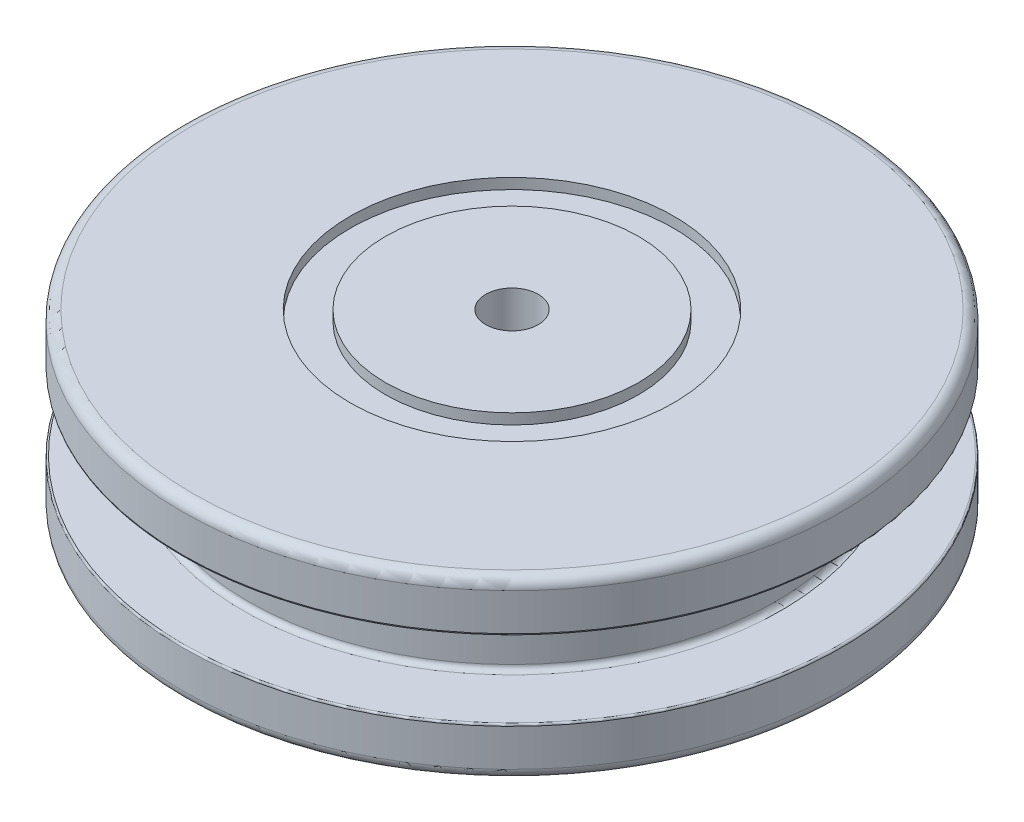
ISO-10303-21;
HEADER;
FILE_DESCRIPTION(('STEP AP214'),'2;1');
FILE_NAME('part.step','',(''),(''),'','','');
FILE_SCHEMA(('AUTOMOTIVE_DESIGN { 1 0 10303 214 1 1 1 1 }'));
ENDSEC;
DATA;
#1=APPLICATION_CONTEXT('core data for automotive mechanical design processes');
#2=APPLICATION_PROTOCOL_DEFINITION('international standard','automotive_design',2000,#1);
#3=PRODUCT_CONTEXT('',#1,'mechanical');
#4=PRODUCT('Part','Part','',(#3));
#5=PRODUCT_RELATED_PRODUCT_CATEGORY('part','',(#4));
#6=PRODUCT_DEFINITION_FORMATION('','',#4);
#7=PRODUCT_DEFINITION_CONTEXT('part definition',#1,'design');
#8=PRODUCT_DEFINITION('design','',#6,#7);
#9=PRODUCT_DEFINITION_SHAPE('','',#8);
#10=(LENGTH_UNIT() NAMED_UNIT(*) SI_UNIT(.MILLI.,.METRE.));
#11=(NAMED_UNIT(*) PLANE_ANGLE_UNIT() SI_UNIT($,.RADIAN.));
#12=(NAMED_UNIT(*) SI_UNIT($,.STERADIAN.) SOLID_ANGLE_UNIT());
#13=UNCERTAINTY_MEASURE_WITH_UNIT(LENGTH_MEASURE(1.E-05),#10,'distance_accuracy_value','');
#14=(GEOMETRIC_REPRESENTATION_CONTEXT(3) GLOBAL_UNCERTAINTY_ASSIGNED_CONTEXT((#13)) GLOBAL_UNIT_ASSIGNED_CONTEXT((#10,
#11,#12)) REPRESENTATION_CONTEXT('',''));
#15=CARTESIAN_POINT('',(0.,0.,0.));
#16=DIRECTION('',(0.,0.,1.));
#17=DIRECTION('',(1.,0.,0.));
#18=AXIS2_PLACEMENT_3D('',#15,#16,#17);
#19=CARTESIAN_POINT('',(0.,0.,0.));
#20=DIRECTION('',(0.,-1.,0.));
#21=DIRECTION('',(0.,0.,-1.));
#22=AXIS2_PLACEMENT_3D('',#19,#20,#21);
#23=CYLINDRICAL_SURFACE('',#22,23.7998);
#24=CARTESIAN_POINT('',(0.,3.4544,0.));
#25=DIRECTION('',(0.,1.,0.));
#26=DIRECTION('',(0.,0.,1.));
#27=AXIS2_PLACEMENT_3D('',#24,#25,#26);
#28=CIRCLE('',#27,23.7998);
#29=CARTESIAN_POINT('',(0.,3.4544,23.7998));
#30=VERTEX_POINT('',#29);
#31=EDGE_CURVE('E44',#30,#30,#28,.F.);
#32=ORIENTED_EDGE('',*,*,#31,.T.);
#33=EDGE_LOOP('',(#32));
#34=FACE_BOUND('',#33,.T.);
#35=CARTESIAN_POINT('',(0.,0.762,0.));
#36=DIRECTION('',(0.,-1.,0.));
#37=DIRECTION('',(0.,0.,-1.));
#38=AXIS2_PLACEMENT_3D('',#35,#36,#37);
#39=CIRCLE('',#38,23.7998);
#40=CARTESIAN_POINT('',(0.,0.762,-23.7998));
#41=VERTEX_POINT('',#40);
#42=EDGE_CURVE('E81',#41,#41,#39,.T.);
#43=ORIENTED_EDGE('',*,*,#42,.F.);
#44=EDGE_LOOP('',(#43));
#45=FACE_BOUND('',#44,.T.);
#46=ADVANCED_FACE('F37',(#34,#45),#23,.T.);
#47=CARTESIAN_POINT('',(-5.08,0.,0.));
#48=DIRECTION('',(0.,1.,0.));
#49=DIRECTION('',(0.,0.,1.));
#50=AXIS2_PLACEMENT_3D('',#47,#48,#49);
#51=PLANE('',#50);
#52=CARTESIAN_POINT('',(0.,0.,0.));
#53=DIRECTION('',(0.,1.,0.));
#54=DIRECTION('',(0.,0.,1.));
#55=AXIS2_PLACEMENT_3D('',#52,#53,#54);
#56=CIRCLE('',#55,3.175);
#57=CARTESIAN_POINT('',(0.,0.,-3.175));
#58=VERTEX_POINT('',#57);
#59=EDGE_CURVE('E88',#58,#58,#56,.T.);
#60=ORIENTED_EDGE('',*,*,#59,.T.);
#61=EDGE_LOOP('',(#60));
#62=FACE_BOUND('',#61,.T.);
#63=CARTESIAN_POINT('',(0.,0.,0.));
#64=DIRECTION('',(0.,-1.,0.));
#65=DIRECTION('',(0.,0.,-1.));
#66=AXIS2_PLACEMENT_3D('',#63,#64,#65);
#67=CIRCLE('',#66,5.08);
#68=CARTESIAN_POINT('',(0.,0.,-5.08));
#69=VERTEX_POINT('',#68);
#70=EDGE_CURVE('E60',#69,#69,#67,.T.);
#71=ORIENTED_EDGE('',*,*,#70,.T.);
#72=EDGE_LOOP('',(#71));
#73=FACE_BOUND('',#72,.T.);
#74=ADVANCED_FACE('F149',(#62,#73),#51,.F.);
#75=CARTESIAN_POINT('',(0.,5.30137558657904,0.));
#76=DIRECTION('',(0.,1.,0.));
#77=DIRECTION('',(0.,0.,1.));
#78=AXIS2_PLACEMENT_3D('',#75,#76,#77);
#79=CONICAL_SURFACE('',#78,5.54381026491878,0.08726646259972);
#80=ORIENTED_EDGE('',*,*,#70,.F.);
#81=EDGE_LOOP('',(#80));
#82=FACE_BOUND('',#81,.T.);
#83=CARTESIAN_POINT('',(0.,5.30137558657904,0.));
#84=DIRECTION('',(0.,-1.,0.));
#85=DIRECTION('',(0.,0.,-1.));
#86=AXIS2_PLACEMENT_3D('',#83,#84,#85);
#87=CIRCLE('',#86,5.54381026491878);
#88=CARTESIAN_POINT('',(0.,5.30137558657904,-5.54381026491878));
#89=VERTEX_POINT('',#88);
#90=EDGE_CURVE('E63',#89,#89,#87,.T.);
#91=ORIENTED_EDGE('',*,*,#90,.T.);
#92=EDGE_LOOP('',(#91));
#93=FACE_BOUND('',#92,.T.);
#94=ADVANCED_FACE('F157',(#82,#93),#79,.T.);
#95=CARTESIAN_POINT('',(0.,5.08,0.));
#96=DIRECTION('',(0.,-1.,0.));
#97=DIRECTION('',(0.,0.,-1.));
#98=AXIS2_PLACEMENT_3D('',#95,#96,#97);
#99=TOROIDAL_SURFACE('',#98,8.07414479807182,2.54);
#100=ORIENTED_EDGE('',*,*,#90,.F.);
#101=EDGE_LOOP('',(#100));
#102=FACE_BOUND('',#101,.T.);
#103=CARTESIAN_POINT('',(0.,7.62,0.));
#104=DIRECTION('',(0.,-1.,0.));
#105=DIRECTION('',(0.,0.,-1.));
#106=AXIS2_PLACEMENT_3D('',#103,#104,#105);
#107=CIRCLE('',#106,8.07414479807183);
#108=CARTESIAN_POINT('',(0.,7.62,-8.07414479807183));
#109=VERTEX_POINT('',#108);
#110=EDGE_CURVE('E66',#109,#109,#107,.T.);
#111=ORIENTED_EDGE('',*,*,#110,.T.);
#112=EDGE_LOOP('',(#111));
#113=FACE_BOUND('',#112,.T.);
#114=ADVANCED_FACE('F242',(#102,#113),#99,.F.);
#115=CARTESIAN_POINT('',(-11.9526975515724,7.62,0.));
#116=DIRECTION('',(0.,1.,0.));
#117=DIRECTION('',(0.,0.,1.));
#118=AXIS2_PLACEMENT_3D('',#115,#116,#117);
#119=PLANE('',#118);
#120=ORIENTED_EDGE('',*,*,#110,.F.);
#121=EDGE_LOOP('',(#120));
#122=FACE_BOUND('',#121,.T.);
#123=CARTESIAN_POINT('',(0.,7.62,0.));
#124=DIRECTION('',(0.,-1.,0.));
#125=DIRECTION('',(0.,0.,-1.));
#126=AXIS2_PLACEMENT_3D('',#123,#124,#125);
#127=CIRCLE('',#126,11.9526975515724);
#128=CARTESIAN_POINT('',(0.,7.62,-11.9526975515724));
#129=VERTEX_POINT('',#128);
#130=EDGE_CURVE('E69',#129,#129,#127,.T.);
#131=ORIENTED_EDGE('',*,*,#130,.T.);
#132=EDGE_LOOP('',(#131));
#133=FACE_BOUND('',#132,.T.);
#134=ADVANCED_FACE('F247',(#122,#133),#119,.F.);
#135=CARTESIAN_POINT('',(0.,5.08,0.));
#136=DIRECTION('',(0.,-1.,0.));
#137=DIRECTION('',(0.,0.,-1.));
#138=AXIS2_PLACEMENT_3D('',#135,#136,#137);
#139=TOROIDAL_SURFACE('',#138,11.9526975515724,2.54);
#140=ORIENTED_EDGE('',*,*,#130,.F.);
#141=EDGE_LOOP('',(#140));
#142=FACE_BOUND('',#141,.T.);
#143=CARTESIAN_POINT('',(0.,6.87605122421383,0.));
#144=DIRECTION('',(0.,-1.,0.));
#145=DIRECTION('',(0.,0.,-1.));
#146=AXIS2_PLACEMENT_3D('',#143,#144,#145);
#147=CIRCLE('',#146,13.7487487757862);
#148=CARTESIAN_POINT('',(0.,6.87605122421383,-13.7487487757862));
#149=VERTEX_POINT('',#148);
#150=EDGE_CURVE('E72',#149,#149,#147,.T.);
#151=ORIENTED_EDGE('',*,*,#150,.T.);
#152=EDGE_LOOP('',(#151));
#153=FACE_BOUND('',#152,.T.);
#154=ADVANCED_FACE('F253',(#142,#153),#139,.F.);
#155=CARTESIAN_POINT('',(0.,0.,0.));
#156=DIRECTION('',(0.,-1.,0.));
#157=DIRECTION('',(0.,0.,-1.));
#158=AXIS2_PLACEMENT_3D('',#155,#156,#157);
#159=CONICAL_SURFACE('',#158,20.6248,0.785398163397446);
#160=ORIENTED_EDGE('',*,*,#150,.F.);
#161=EDGE_LOOP('',(#160));
#162=FACE_BOUND('',#161,.T.);
#163=CARTESIAN_POINT('',(0.,0.,0.));
#164=DIRECTION('',(0.,-1.,0.));
#165=DIRECTION('',(0.,0.,-1.));
#166=AXIS2_PLACEMENT_3D('',#163,#164,#165);
#167=CIRCLE('',#166,20.6248);
#168=CARTESIAN_POINT('',(0.,0.,-20.6248));
#169=VERTEX_POINT('',#168);
#170=EDGE_CURVE('E75',#169,#169,#167,.T.);
#171=ORIENTED_EDGE('',*,*,#170,.T.);
#172=EDGE_LOOP('',(#171));
#173=FACE_BOUND('',#172,.T.);
#174=ADVANCED_FACE('F259',(#162,#173),#159,.F.);
#175=CARTESIAN_POINT('',(-20.6248,0.,0.));
#176=DIRECTION('',(0.,1.,0.));
#177=DIRECTION('',(0.,0.,1.));
#178=AXIS2_PLACEMENT_3D('',#175,#176,#177);
#179=PLANE('',#178);
#180=ORIENTED_EDGE('',*,*,#170,.F.);
#181=EDGE_LOOP('',(#180));
#182=FACE_BOUND('',#181,.T.);
#183=CARTESIAN_POINT('',(0.,0.,0.));
#184=DIRECTION('',(0.,-1.,0.));
#185=DIRECTION('',(0.,0.,-1.));
#186=AXIS2_PLACEMENT_3D('',#183,#184,#185);
#187=CIRCLE('',#186,23.0378);
#188=CARTESIAN_POINT('',(0.,0.,-23.0378));
#189=VERTEX_POINT('',#188);
#190=EDGE_CURVE('E78',#189,#189,#187,.T.);
#191=ORIENTED_EDGE('',*,*,#190,.T.);
#192=EDGE_LOOP('',(#191));
#193=FACE_BOUND('',#192,.T.);
#194=ADVANCED_FACE('F265',(#182,#193),#179,.F.);
#195=CARTESIAN_POINT('',(0.,0.762,0.));
#196=DIRECTION('',(0.,-1.,0.));
#197=DIRECTION('',(0.,0.,-1.));
#198=AXIS2_PLACEMENT_3D('',#195,#196,#197);
#199=TOROIDAL_SURFACE('',#198,23.0378,0.761999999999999);
#200=ORIENTED_EDGE('',*,*,#190,.F.);
#201=EDGE_LOOP('',(#200));
#202=FACE_BOUND('',#201,.T.);
#203=ORIENTED_EDGE('',*,*,#42,.T.);
#204=EDGE_LOOP('',(#203));
#205=FACE_BOUND('',#204,.T.);
#206=ADVANCED_FACE('F230',(#202,#205),#199,.T.);
#207=CARTESIAN_POINT('',(0.,7.62,0.));
#208=DIRECTION('',(0.,-1.,0.));
#209=DIRECTION('',(0.,0.,-1.));
#210=AXIS2_PLACEMENT_3D('',#207,#208,#209);
#211=CYLINDRICAL_SURFACE('',#210,3.175);
#212=CARTESIAN_POINT('',(0.,7.62,0.));
#213=DIRECTION('',(0.,1.,0.));
#214=DIRECTION('',(0.,0.,1.));
#215=AXIS2_PLACEMENT_3D('',#212,#213,#214);
#216=CIRCLE('',#215,3.175);
#217=CARTESIAN_POINT('',(0.,7.62,-3.175));
#218=VERTEX_POINT('',#217);
#219=EDGE_CURVE('E87',#218,#218,#216,.T.);
#220=CARTESIAN_POINT('',(0.,7.62,-3.175));
#221=CARTESIAN_POINT('',(0.,7.540625,-3.175));
#222=CARTESIAN_POINT('',(0.,7.46125,-3.175));
#223=CARTESIAN_POINT('',(0.,7.3025,-3.175));
#224=CARTESIAN_POINT('',(0.,7.223125,-3.175));
#225=CARTESIAN_POINT('',(0.,7.064375,-3.175));
#226=CARTESIAN_POINT('',(0.,6.985,-3.175));
#227=CARTESIAN_POINT('',(0.,6.82625,-3.175));
#228=CARTESIAN_POINT('',(0.,6.746875,-3.175));
#229=CARTESIAN_POINT('',(0.,6.588125,-3.175));
#230=CARTESIAN_POINT('',(0.,6.50875,-3.175));
#231=CARTESIAN_POINT('',(0.,6.35,-3.175));
#232=CARTESIAN_POINT('',(0.,6.270625,-3.175));
#233=CARTESIAN_POINT('',(0.,6.111875,-3.175));
#234=CARTESIAN_POINT('',(0.,6.0325,-3.175));
#235=CARTESIAN_POINT('',(0.,5.87375,-3.175));
#236=CARTESIAN_POINT('',(0.,5.794375,-3.175));
#237=CARTESIAN_POINT('',(0.,5.635625,-3.175));
#238=CARTESIAN_POINT('',(0.,5.55625,-3.175));
#239=CARTESIAN_POINT('',(0.,5.3975,-3.175));
#240=CARTESIAN_POINT('',(0.,5.318125,-3.175));
#241=CARTESIAN_POINT('',(0.,5.159375,-3.175));
#242=CARTESIAN_POINT('',(0.,5.08,-3.175));
#243=CARTESIAN_POINT('',(0.,4.92125,-3.175));
#244=CARTESIAN_POINT('',(0.,4.841875,-3.175));
#245=CARTESIAN_POINT('',(0.,4.683125,-3.175));
#246=CARTESIAN_POINT('',(0.,4.60375,-3.175));
#247=CARTESIAN_POINT('',(0.,4.445,-3.175));
#248=CARTESIAN_POINT('',(0.,4.365625,-3.175));
#249=CARTESIAN_POINT('',(0.,4.206875,-3.175));
#250=CARTESIAN_POINT('',(0.,4.1275,-3.175));
#251=CARTESIAN_POINT('',(0.,3.96875,-3.175));
#252=CARTESIAN_POINT('',(0.,3.889375,-3.175));
#253=CARTESIAN_POINT('',(0.,3.730625,-3.175));
#254=CARTESIAN_POINT('',(0.,3.65125,-3.175));
#255=CARTESIAN_POINT('',(0.,3.4925,-3.175));
#256=CARTESIAN_POINT('',(0.,3.413125,-3.175));
#257=CARTESIAN_POINT('',(0.,3.254375,-3.175));
#258=CARTESIAN_POINT('',(0.,3.175,-3.175));
#259=CARTESIAN_POINT('',(0.,3.01625,-3.175));
#260=CARTESIAN_POINT('',(0.,2.936875,-3.175));
#261=CARTESIAN_POINT('',(0.,2.778125,-3.175));
#262=CARTESIAN_POINT('',(0.,2.69875,-3.175));
#263=CARTESIAN_POINT('',(0.,2.54,-3.175));
#264=CARTESIAN_POINT('',(0.,2.460625,-3.175));
#265=CARTESIAN_POINT('',(0.,2.301875,-3.175));
#266=CARTESIAN_POINT('',(0.,2.2225,-3.175));
#267=CARTESIAN_POINT('',(0.,2.06375,-3.175));
#268=CARTESIAN_POINT('',(0.,1.984375,-3.175));
#269=CARTESIAN_POINT('',(0.,1.825625,-3.175));
#270=CARTESIAN_POINT('',(0.,1.74625,-3.175));
#271=CARTESIAN_POINT('',(0.,1.5875,-3.175));
#272=CARTESIAN_POINT('',(0.,1.508125,-3.175));
#273=CARTESIAN_POINT('',(0.,1.349375,-3.175));
#274=CARTESIAN_POINT('',(0.,1.27,-3.175));
#275=CARTESIAN_POINT('',(0.,1.11125,-3.175));
#276=CARTESIAN_POINT('',(0.,1.031875,-3.175));
#277=CARTESIAN_POINT('',(0.,0.873125,-3.175));
#278=CARTESIAN_POINT('',(0.,0.79375,-3.175));
#279=CARTESIAN_POINT('',(0.,0.635,-3.175));
#280=CARTESIAN_POINT('',(0.,0.555625,-3.175));
#281=CARTESIAN_POINT('',(0.,0.396875,-3.175));
#282=CARTESIAN_POINT('',(0.,0.3175,-3.175));
#283=CARTESIAN_POINT('',(0.,0.15875,-3.175));
#284=CARTESIAN_POINT('',(0.,0.0793749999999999,-3.175));
#285=CARTESIAN_POINT('',(0.,0.,-3.175));
#286=B_SPLINE_CURVE_WITH_KNOTS('',3,(#220,#221,#222,#223,#224,#225,#226,#227,#228,#229,#230,
#231,#232,#233,#234,#235,#236,#237,#238,#239,#240,#241,#242,#243,#244,#245,#246,#247,#248,#249,
#250,#251,#252,#253,#254,#255,#256,#257,#258,#259,#260,#261,#262,#263,#264,#265,#266,#267,#268,
#269,#270,#271,#272,#273,#274,#275,#276,#277,#278,#279,#280,#281,#282,#283,#284,#285),
.UNSPECIFIED.,.F.,.F.,(4,2,2,2,2,2,2,2,2,2,2,2,2,2,2,2,2,2,2,2,2,2,2,2,2,2,2,2,2,2,2,2,4),(0.,
0.238125,0.47625,0.714375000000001,0.9525,1.190625,1.42875,1.666875,1.905,2.143125,2.38125,
2.619375,2.8575,3.095625,3.33375,3.571875,3.81,4.048125,4.28625,4.524375,4.7625,5.000625,
5.23875,5.476875,5.715,5.953125,6.19125,6.429375,6.6675,6.905625,7.14375,7.381875,7.62),.UNSPECIFIED.);
#287=EDGE_CURVE('BSEAM225',#218,#58,#286,.T.);
#288=ORIENTED_EDGE('',*,*,#219,.T.);
#289=ORIENTED_EDGE('',*,*,#59,.F.);
#290=ORIENTED_EDGE('',*,*,#287,.T.);
#291=ORIENTED_EDGE('',*,*,#287,.F.);
#292=EDGE_LOOP('',(#288,#290,#289,#291));
#293=FACE_BOUND('',#292,.T.);
#294=ADVANCED_FACE('F225',(#293),#211,.F.);
#295=CARTESIAN_POINT('',(0.,7.62,0.));
#296=DIRECTION('',(0.,1.,0.));
#297=DIRECTION('',(0.,0.,1.));
#298=AXIS2_PLACEMENT_3D('',#295,#296,#297);
#299=PLANE('',#298);
#300=CARTESIAN_POINT('',(0.,7.62,0.));
#301=DIRECTION('',(0.,1.,0.));
#302=DIRECTION('',(0.,0.,1.));
#303=AXIS2_PLACEMENT_3D('',#300,#301,#302);
#304=CIRCLE('',#303,1.89865);
#305=CARTESIAN_POINT('',(0.,7.62,1.89865));
#306=VERTEX_POINT('',#305);
#307=EDGE_CURVE('E117',#306,#306,#304,.T.);
#308=ORIENTED_EDGE('',*,*,#307,.T.);
#309=EDGE_LOOP('',(#308));
#310=FACE_BOUND('',#309,.T.);
#311=ORIENTED_EDGE('',*,*,#219,.F.);
#312=EDGE_LOOP('',(#311));
#313=FACE_BOUND('',#312,.T.);
#314=ADVANCED_FACE('F221',(#310,#313),#299,.F.);
#315=CARTESIAN_POINT('',(-23.7998,3.5814,0.));
#316=DIRECTION('',(0.,1.,0.));
#317=DIRECTION('',(0.,0.,1.));
#318=AXIS2_PLACEMENT_3D('',#315,#316,#317);
#319=PLANE('',#318);
#320=CARTESIAN_POINT('',(0.,3.5814,0.));
#321=DIRECTION('',(0.,1.,0.));
#322=DIRECTION('',(0.,0.,1.));
#323=AXIS2_PLACEMENT_3D('',#320,#321,#322);
#324=CIRCLE('',#323,23.6728);
#325=CARTESIAN_POINT('',(0.,3.5814,23.6728));
#326=VERTEX_POINT('',#325);
#327=EDGE_CURVE('E10',#326,#326,#324,.T.);
#328=ORIENTED_EDGE('',*,*,#327,.T.);
#329=EDGE_LOOP('',(#328));
#330=FACE_BOUND('',#329,.T.);
#331=CARTESIAN_POINT('',(0.,3.5814,0.));
#332=DIRECTION('',(0.,-1.,0.));
#333=DIRECTION('',(0.,0.,-1.));
#334=AXIS2_PLACEMENT_3D('',#331,#332,#333);
#335=CIRCLE('',#334,19.431);
#336=CARTESIAN_POINT('',(0.,3.5814,-19.431));
#337=VERTEX_POINT('',#336);
#338=EDGE_CURVE('E103',#337,#337,#335,.T.);
#339=ORIENTED_EDGE('',*,*,#338,.T.);
#340=EDGE_LOOP('',(#339));
#341=FACE_BOUND('',#340,.T.);
#342=ADVANCED_FACE('F217',(#330,#341),#319,.T.);
#343=CARTESIAN_POINT('',(0.,3.9624,0.));
#344=DIRECTION('',(0.,-1.,0.));
#345=DIRECTION('',(0.,0.,-1.));
#346=AXIS2_PLACEMENT_3D('',#343,#344,#345);
#347=TOROIDAL_SURFACE('',#346,19.431,0.381);
#348=CARTESIAN_POINT('',(0.,3.9624,0.));
#349=DIRECTION('',(0.,-1.,0.));
#350=DIRECTION('',(0.,0.,-1.));
#351=AXIS2_PLACEMENT_3D('',#348,#349,#350);
#352=CIRCLE('',#351,19.05);
#353=CARTESIAN_POINT('',(0.,3.9624,-19.05));
#354=VERTEX_POINT('',#353);
#355=EDGE_CURVE('E108',#354,#354,#352,.T.);
#356=ORIENTED_EDGE('',*,*,#355,.T.);
#357=EDGE_LOOP('',(#356));
#358=FACE_BOUND('',#357,.T.);
#359=ORIENTED_EDGE('',*,*,#338,.F.);
#360=EDGE_LOOP('',(#359));
#361=FACE_BOUND('',#360,.T.);
#362=ADVANCED_FACE('F212',(#358,#361),#347,.F.);
#363=CARTESIAN_POINT('',(0.,0.,0.));
#364=DIRECTION('',(0.,-1.,0.));
#365=DIRECTION('',(0.,0.,-1.));
#366=AXIS2_PLACEMENT_3D('',#363,#364,#365);
#367=CYLINDRICAL_SURFACE('',#366,19.05);
#368=CARTESIAN_POINT('',(0.,8.7376,0.));
#369=DIRECTION('',(0.,-1.,0.));
#370=DIRECTION('',(0.,0.,-1.));
#371=AXIS2_PLACEMENT_3D('',#368,#369,#370);
#372=CIRCLE('',#371,19.05);
#373=CARTESIAN_POINT('',(0.,8.7376,-19.05));
#374=VERTEX_POINT('',#373);
#375=EDGE_CURVE('E111',#374,#374,#372,.T.);
#376=ORIENTED_EDGE('',*,*,#375,.T.);
#377=EDGE_LOOP('',(#376));
#378=FACE_BOUND('',#377,.T.);
#379=ORIENTED_EDGE('',*,*,#355,.F.);
#380=EDGE_LOOP('',(#379));
#381=FACE_BOUND('',#380,.T.);
#382=ADVANCED_FACE('F206',(#378,#381),#367,.T.);
#383=CARTESIAN_POINT('',(0.,8.7376,0.));
#384=DIRECTION('',(0.,-1.,0.));
#385=DIRECTION('',(0.,0.,-1.));
#386=AXIS2_PLACEMENT_3D('',#383,#384,#385);
#387=TOROIDAL_SURFACE('',#386,19.431,0.380999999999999);
#388=CARTESIAN_POINT('',(0.,9.11859999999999,0.));
#389=DIRECTION('',(0.,-1.,0.));
#390=DIRECTION('',(0.,0.,-1.));
#391=AXIS2_PLACEMENT_3D('',#388,#389,#390);
#392=CIRCLE('',#391,19.431);
#393=CARTESIAN_POINT('',(0.,9.11859999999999,-19.431));
#394=VERTEX_POINT('',#393);
#395=EDGE_CURVE('E114',#394,#394,#392,.T.);
#396=ORIENTED_EDGE('',*,*,#395,.T.);
#397=EDGE_LOOP('',(#396));
#398=FACE_BOUND('',#397,.T.);
#399=ORIENTED_EDGE('',*,*,#375,.F.);
#400=EDGE_LOOP('',(#399));
#401=FACE_BOUND('',#400,.T.);
#402=ADVANCED_FACE('F200',(#398,#401),#387,.F.);
#403=CARTESIAN_POINT('',(-23.7998,9.11859999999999,0.));
#404=DIRECTION('',(0.,-1.,0.));
#405=DIRECTION('',(0.,0.,-1.));
#406=AXIS2_PLACEMENT_3D('',#403,#404,#405);
#407=PLANE('',#406);
#408=CARTESIAN_POINT('',(0.,9.11859999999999,0.));
#409=DIRECTION('',(0.,-1.,0.));
#410=DIRECTION('',(0.,0.,-1.));
#411=AXIS2_PLACEMENT_3D('',#408,#409,#410);
#412=CIRCLE('',#411,23.6728);
#413=CARTESIAN_POINT('',(0.,9.11859999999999,-23.6728));
#414=VERTEX_POINT('',#413);
#415=EDGE_CURVE('E52',#414,#414,#412,.T.);
#416=ORIENTED_EDGE('',*,*,#415,.T.);
#417=EDGE_LOOP('',(#416));
#418=FACE_BOUND('',#417,.T.);
#419=ORIENTED_EDGE('',*,*,#395,.F.);
#420=EDGE_LOOP('',(#419));
#421=FACE_BOUND('',#420,.T.);
#422=ADVANCED_FACE('F131',(#418,#421),#407,.T.);
#423=CARTESIAN_POINT('',(-23.0378,12.7,0.));
#424=DIRECTION('',(0.,-1.,0.));
#425=DIRECTION('',(0.,0.,-1.));
#426=AXIS2_PLACEMENT_3D('',#423,#424,#425);
#427=PLANE('',#426);
#428=CARTESIAN_POINT('',(0.,12.7,0.));
#429=DIRECTION('',(0.,1.,0.));
#430=DIRECTION('',(0.,0.,1.));
#431=AXIS2_PLACEMENT_3D('',#428,#429,#430);
#432=CIRCLE('',#431,1.89865);
#433=CARTESIAN_POINT('',(0.,12.7,1.89865));
#434=VERTEX_POINT('',#433);
#435=EDGE_CURVE('E120',#434,#434,#432,.T.);
#436=ORIENTED_EDGE('',*,*,#435,.F.);
#437=EDGE_LOOP('',(#436));
#438=FACE_BOUND('',#437,.T.);
#439=CARTESIAN_POINT('',(0.,12.7,0.));
#440=DIRECTION('',(0.,1.,0.));
#441=DIRECTION('',(0.,0.,1.));
#442=AXIS2_PLACEMENT_3D('',#439,#440,#441);
#443=CIRCLE('',#442,9.144);
#444=CARTESIAN_POINT('',(0.,12.7,9.144));
#445=VERTEX_POINT('',#444);
#446=EDGE_CURVE('E100',#445,#445,#443,.T.);
#447=ORIENTED_EDGE('',*,*,#446,.T.);
#448=EDGE_LOOP('',(#447));
#449=FACE_BOUND('',#448,.T.);
#450=ADVANCED_FACE('F127',(#438,#449),#427,.F.);
#451=CARTESIAN_POINT('',(0.,11.938,0.));
#452=DIRECTION('',(0.,1.,0.));
#453=DIRECTION('',(0.,0.,1.));
#454=AXIS2_PLACEMENT_3D('',#451,#452,#453);
#455=CYLINDRICAL_SURFACE('',#454,9.144);
#456=CARTESIAN_POINT('',(0.,11.938,0.));
#457=DIRECTION('',(0.,1.,0.));
#458=DIRECTION('',(0.,0.,1.));
#459=AXIS2_PLACEMENT_3D('',#456,#457,#458);
#460=CIRCLE('',#459,9.144);
#461=CARTESIAN_POINT('',(0.,11.938,9.144));
#462=VERTEX_POINT('',#461);
#463=EDGE_CURVE('E97',#462,#462,#460,.T.);
#464=CARTESIAN_POINT('',(0.,11.938,9.144));
#465=CARTESIAN_POINT('',(0.,11.9459375,9.144));
#466=CARTESIAN_POINT('',(0.,11.953875,9.144));
#467=CARTESIAN_POINT('',(0.,11.96975,9.144));
#468=CARTESIAN_POINT('',(0.,11.9776875,9.144));
#469=CARTESIAN_POINT('',(0.,11.9935625,9.144));
#470=CARTESIAN_POINT('',(0.,12.0015,9.144));
#471=CARTESIAN_POINT('',(0.,12.017375,9.144));
#472=CARTESIAN_POINT('',(0.,12.0253125,9.144));
#473=CARTESIAN_POINT('',(0.,12.0411875,9.144));
#474=CARTESIAN_POINT('',(0.,12.049125,9.144));
#475=CARTESIAN_POINT('',(0.,12.065,9.144));
#476=CARTESIAN_POINT('',(0.,12.0729375,9.144));
#477=CARTESIAN_POINT('',(0.,12.0888125,9.144));
#478=CARTESIAN_POINT('',(0.,12.09675,9.144));
#479=CARTESIAN_POINT('',(0.,12.112625,9.144));
#480=CARTESIAN_POINT('',(0.,12.1205625,9.144));
#481=CARTESIAN_POINT('',(0.,12.1364375,9.144));
#482=CARTESIAN_POINT('',(0.,12.144375,9.144));
#483=CARTESIAN_POINT('',(0.,12.16025,9.144));
#484=CARTESIAN_POINT('',(0.,12.1681875,9.144));
#485=CARTESIAN_POINT('',(0.,12.1840625,9.144));
#486=CARTESIAN_POINT('',(0.,12.192,9.144));
#487=CARTESIAN_POINT('',(0.,12.207875,9.144));
#488=CARTESIAN_POINT('',(0.,12.2158125,9.144));
#489=CARTESIAN_POINT('',(0.,12.2316875,9.144));
#490=CARTESIAN_POINT('',(0.,12.239625,9.144));
#491=CARTESIAN_POINT('',(0.,12.2555,9.144));
#492=CARTESIAN_POINT('',(0.,12.2634375,9.144));
#493=CARTESIAN_POINT('',(0.,12.2793125,9.144));
#494=CARTESIAN_POINT('',(0.,12.28725,9.144));
#495=CARTESIAN_POINT('',(0.,12.303125,9.144));
#496=CARTESIAN_POINT('',(0.,12.3110625,9.144));
#497=CARTESIAN_POINT('',(0.,12.3269375,9.144));
#498=CARTESIAN_POINT('',(0.,12.334875,9.144));
#499=CARTESIAN_POINT('',(0.,12.35075,9.144));
#500=CARTESIAN_POINT('',(0.,12.3586875,9.144));
#501=CARTESIAN_POINT('',(0.,12.3745625,9.144));
#502=CARTESIAN_POINT('',(0.,12.3825,9.144));
#503=CARTESIAN_POINT('',(0.,12.398375,9.144));
#504=CARTESIAN_POINT('',(0.,12.4063125,9.144));
#505=CARTESIAN_POINT('',(0.,12.4221875,9.144));
#506=CARTESIAN_POINT('',(0.,12.430125,9.144));
#507=CARTESIAN_POINT('',(0.,12.446,9.144));
#508=CARTESIAN_POINT('',(0.,12.4539375,9.144));
#509=CARTESIAN_POINT('',(0.,12.4698125,9.144));
#510=CARTESIAN_POINT('',(0.,12.47775,9.144));
#511=CARTESIAN_POINT('',(0.,12.493625,9.144));
#512=CARTESIAN_POINT('',(0.,12.5015625,9.144));
#513=CARTESIAN_POINT('',(0.,12.5174375,9.144));
#514=CARTESIAN_POINT('',(0.,12.525375,9.144));
#515=CARTESIAN_POINT('',(0.,12.54125,9.144));
#516=CARTESIAN_POINT('',(0.,12.5491875,9.144));
#517=CARTESIAN_POINT('',(0.,12.5650625,9.144));
#518=CARTESIAN_POINT('',(0.,12.573,9.144));
#519=CARTESIAN_POINT('',(0.,12.588875,9.144));
#520=CARTESIAN_POINT('',(0.,12.5968125,9.144));
#521=CARTESIAN_POINT('',(0.,12.6126875,9.144));
#522=CARTESIAN_POINT('',(0.,12.620625,9.144));
#523=CARTESIAN_POINT('',(0.,12.6365,9.144));
#524=CARTESIAN_POINT('',(0.,12.6444375,9.144));
#525=CARTESIAN_POINT('',(0.,12.6603125,9.144));
#526=CARTESIAN_POINT('',(0.,12.66825,9.144));
#527=CARTESIAN_POINT('',(0.,12.684125,9.144));
#528=CARTESIAN_POINT('',(0.,12.6920625,9.144));
#529=CARTESIAN_POINT('',(0.,12.7,9.144));
#530=B_SPLINE_CURVE_WITH_KNOTS('',3,(#464,#465,#466,#467,#468,#469,#470,#471,#472,#473,#474,
#475,#476,#477,#478,#479,#480,#481,#482,#483,#484,#485,#486,#487,#488,#489,#490,#491,#492,#493,
#494,#495,#496,#497,#498,#499,#500,#501,#502,#503,#504,#505,#506,#507,#508,#509,#510,#511,#512,
#513,#514,#515,#516,#517,#518,#519,#520,#521,#522,#523,#524,#525,#526,#527,#528,#529),
.UNSPECIFIED.,.F.,.F.,(4,2,2,2,2,2,2,2,2,2,2,2,2,2,2,2,2,2,2,2,2,2,2,2,2,2,2,2,2,2,2,2,4),(0.,
0.0238124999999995,0.0476249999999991,0.0714374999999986,0.0952499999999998,0.119062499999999,
0.142874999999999,0.166687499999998,0.1905,0.214312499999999,0.238124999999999,0.2619375,
0.28575,0.309562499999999,0.333374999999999,0.3571875,0.380999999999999,0.404812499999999,
0.428625,0.4524375,0.476249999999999,0.500062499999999,0.523875,0.5476875,0.571499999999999,
0.595312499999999,0.619125,0.642937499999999,0.666749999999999,0.6905625,0.714375,
0.738187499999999,0.761999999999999),.UNSPECIFIED.);
#531=EDGE_CURVE('BSEAM130',#462,#445,#530,.T.);
#532=ORIENTED_EDGE('',*,*,#463,.T.);
#533=ORIENTED_EDGE('',*,*,#446,.F.);
#534=ORIENTED_EDGE('',*,*,#531,.T.);
#535=ORIENTED_EDGE('',*,*,#531,.F.);
#536=EDGE_LOOP('',(#532,#534,#533,#535));
#537=FACE_BOUND('',#536,.T.);
#538=ADVANCED_FACE('F130',(#537),#455,.T.);
#539=CARTESIAN_POINT('',(0.,11.938,0.));
#540=DIRECTION('',(0.,1.,0.));
#541=DIRECTION('',(0.,0.,1.));
#542=AXIS2_PLACEMENT_3D('',#539,#540,#541);
#543=PLANE('',#542);
#544=ORIENTED_EDGE('',*,*,#463,.F.);
#545=EDGE_LOOP('',(#544));
#546=FACE_BOUND('',#545,.T.);
#547=CARTESIAN_POINT('',(0.,11.938,0.));
#548=DIRECTION('',(0.,1.,0.));
#549=DIRECTION('',(0.,0.,1.));
#550=AXIS2_PLACEMENT_3D('',#547,#548,#549);
#551=CIRCLE('',#550,11.684);
#552=CARTESIAN_POINT('',(0.,11.938,11.684));
#553=VERTEX_POINT('',#552);
#554=EDGE_CURVE('E91',#553,#553,#551,.T.);
#555=ORIENTED_EDGE('',*,*,#554,.T.);
#556=EDGE_LOOP('',(#555));
#557=FACE_BOUND('',#556,.T.);
#558=ADVANCED_FACE('F137',(#546,#557),#543,.T.);
#559=CARTESIAN_POINT('',(0.,11.938,0.));
#560=DIRECTION('',(0.,1.,0.));
#561=DIRECTION('',(0.,0.,1.));
#562=AXIS2_PLACEMENT_3D('',#559,#560,#561);
#563=CYLINDRICAL_SURFACE('',#562,11.684);
#564=CARTESIAN_POINT('',(0.,12.7,0.));
#565=DIRECTION('',(0.,1.,0.));
#566=DIRECTION('',(0.,0.,1.));
#567=AXIS2_PLACEMENT_3D('',#564,#565,#566);
#568=CIRCLE('',#567,11.684);
#569=CARTESIAN_POINT('',(0.,12.7,11.684));
#570=VERTEX_POINT('',#569);
#571=EDGE_CURVE('E94',#570,#570,#568,.T.);
#572=CARTESIAN_POINT('',(0.,11.938,11.684));
#573=CARTESIAN_POINT('',(0.,11.9459375,11.684));
#574=CARTESIAN_POINT('',(0.,11.953875,11.684));
#575=CARTESIAN_POINT('',(0.,11.96975,11.684));
#576=CARTESIAN_POINT('',(0.,11.9776875,11.684));
#577=CARTESIAN_POINT('',(0.,11.9935625,11.684));
#578=CARTESIAN_POINT('',(0.,12.0015,11.684));
#579=CARTESIAN_POINT('',(0.,12.017375,11.684));
#580=CARTESIAN_POINT('',(0.,12.0253125,11.684));
#581=CARTESIAN_POINT('',(0.,12.0411875,11.684));
#582=CARTESIAN_POINT('',(0.,12.049125,11.684));
#583=CARTESIAN_POINT('',(0.,12.065,11.684));
#584=CARTESIAN_POINT('',(0.,12.0729375,11.684));
#585=CARTESIAN_POINT('',(0.,12.0888125,11.684));
#586=CARTESIAN_POINT('',(0.,12.09675,11.684));
#587=CARTESIAN_POINT('',(0.,12.112625,11.684));
#588=CARTESIAN_POINT('',(0.,12.1205625,11.684));
#589=CARTESIAN_POINT('',(0.,12.1364375,11.684));
#590=CARTESIAN_POINT('',(0.,12.144375,11.684));
#591=CARTESIAN_POINT('',(0.,12.16025,11.684));
#592=CARTESIAN_POINT('',(0.,12.1681875,11.684));
#593=CARTESIAN_POINT('',(0.,12.1840625,11.684));
#594=CARTESIAN_POINT('',(0.,12.192,11.684));
#595=CARTESIAN_POINT('',(0.,12.207875,11.684));
#596=CARTESIAN_POINT('',(0.,12.2158125,11.684));
#597=CARTESIAN_POINT('',(0.,12.2316875,11.684));
#598=CARTESIAN_POINT('',(0.,12.239625,11.684));
#599=CARTESIAN_POINT('',(0.,12.2555,11.684));
#600=CARTESIAN_POINT('',(0.,12.2634375,11.684));
#601=CARTESIAN_POINT('',(0.,12.2793125,11.684));
#602=CARTESIAN_POINT('',(0.,12.28725,11.684));
#603=CARTESIAN_POINT('',(0.,12.303125,11.684));
#604=CARTESIAN_POINT('',(0.,12.3110625,11.684));
#605=CARTESIAN_POINT('',(0.,12.3269375,11.684));
#606=CARTESIAN_POINT('',(0.,12.334875,11.684));
#607=CARTESIAN_POINT('',(0.,12.35075,11.684));
#608=CARTESIAN_POINT('',(0.,12.3586875,11.684));
#609=CARTESIAN_POINT('',(0.,12.3745625,11.684));
#610=CARTESIAN_POINT('',(0.,12.3825,11.684));
#611=CARTESIAN_POINT('',(0.,12.398375,11.684));
#612=CARTESIAN_POINT('',(0.,12.4063125,11.684));
#613=CARTESIAN_POINT('',(0.,12.4221875,11.684));
#614=CARTESIAN_POINT('',(0.,12.430125,11.684));
#615=CARTESIAN_POINT('',(0.,12.446,11.684));
#616=CARTESIAN_POINT('',(0.,12.4539375,11.684));
#617=CARTESIAN_POINT('',(0.,12.4698125,11.684));
#618=CARTESIAN_POINT('',(0.,12.47775,11.684));
#619=CARTESIAN_POINT('',(0.,12.493625,11.684));
#620=CARTESIAN_POINT('',(0.,12.5015625,11.684));
#621=CARTESIAN_POINT('',(0.,12.5174375,11.684));
#622=CARTESIAN_POINT('',(0.,12.525375,11.684));
#623=CARTESIAN_POINT('',(0.,12.54125,11.684));
#624=CARTESIAN_POINT('',(0.,12.5491875,11.684));
#625=CARTESIAN_POINT('',(0.,12.5650625,11.684));
#626=CARTESIAN_POINT('',(0.,12.573,11.684));
#627=CARTESIAN_POINT('',(0.,12.588875,11.684));
#628=CARTESIAN_POINT('',(0.,12.5968125,11.684));
#629=CARTESIAN_POINT('',(0.,12.6126875,11.684));
#630=CARTESIAN_POINT('',(0.,12.620625,11.684));
#631=CARTESIAN_POINT('',(0.,12.6365,11.684));
#632=CARTESIAN_POINT('',(0.,12.6444375,11.684));
#633=CARTESIAN_POINT('',(0.,12.6603125,11.684));
#634=CARTESIAN_POINT('',(0.,12.66825,11.684));
#635=CARTESIAN_POINT('',(0.,12.684125,11.684));
#636=CARTESIAN_POINT('',(0.,12.6920625,11.684));
#637=CARTESIAN_POINT('',(0.,12.7,11.684));
#638=B_SPLINE_CURVE_WITH_KNOTS('',3,(#572,#573,#574,#575,#576,#577,#578,#579,#580,#581,#582,
#583,#584,#585,#586,#587,#588,#589,#590,#591,#592,#593,#594,#595,#596,#597,#598,#599,#600,#601,
#602,#603,#604,#605,#606,#607,#608,#609,#610,#611,#612,#613,#614,#615,#616,#617,#618,#619,#620,
#621,#622,#623,#624,#625,#626,#627,#628,#629,#630,#631,#632,#633,#634,#635,#636,#637),
.UNSPECIFIED.,.F.,.F.,(4,2,2,2,2,2,2,2,2,2,2,2,2,2,2,2,2,2,2,2,2,2,2,2,2,2,2,2,2,2,2,2,4),(0.,
0.0238125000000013,0.0476250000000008,0.0714375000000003,0.0952500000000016,0.119062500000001,
0.142875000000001,0.1666875,0.190500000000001,0.214312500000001,0.238125,0.261937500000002,
0.285750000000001,0.309562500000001,0.333375,0.357187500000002,0.381000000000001,
0.404812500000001,0.428625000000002,0.452437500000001,0.476250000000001,0.500062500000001,
0.523875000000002,0.547687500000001,0.571500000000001,0.5953125,0.619125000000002,
0.642937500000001,0.666750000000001,0.690562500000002,0.714375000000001,0.738187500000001,
0.762000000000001),.UNSPECIFIED.);
#639=EDGE_CURVE('BSEAM144',#553,#570,#638,.T.);
#640=ORIENTED_EDGE('',*,*,#554,.F.);
#641=ORIENTED_EDGE('',*,*,#571,.T.);
#642=ORIENTED_EDGE('',*,*,#639,.T.);
#643=ORIENTED_EDGE('',*,*,#639,.F.);
#644=EDGE_LOOP('',(#640,#642,#641,#643));
#645=FACE_BOUND('',#644,.T.);
#646=ADVANCED_FACE('F144',(#645),#563,.F.);
#647=ORIENTED_EDGE('',*,*,#571,.F.);
#648=EDGE_LOOP('',(#647));
#649=FACE_BOUND('',#648,.T.);
#650=CARTESIAN_POINT('',(0.,12.7,0.));
#651=DIRECTION('',(0.,-1.,0.));
#652=DIRECTION('',(0.,0.,-1.));
#653=AXIS2_PLACEMENT_3D('',#650,#651,#652);
#654=CIRCLE('',#653,23.0378);
#655=CARTESIAN_POINT('',(0.,12.7,-23.0378));
#656=VERTEX_POINT('',#655);
#657=EDGE_CURVE('E57',#656,#656,#654,.T.);
#658=ORIENTED_EDGE('',*,*,#657,.F.);
#659=EDGE_LOOP('',(#658));
#660=FACE_BOUND('',#659,.T.);
#661=ADVANCED_FACE('F133',(#649,#660),#427,.F.);
#662=CARTESIAN_POINT('',(0.,11.938,0.));
#663=DIRECTION('',(0.,-1.,0.));
#664=DIRECTION('',(0.,0.,-1.));
#665=AXIS2_PLACEMENT_3D('',#662,#663,#664);
#666=TOROIDAL_SURFACE('',#665,23.0378,0.762);
#667=CARTESIAN_POINT('',(0.,11.938,0.));
#668=DIRECTION('',(0.,-1.,0.));
#669=DIRECTION('',(0.,0.,-1.));
#670=AXIS2_PLACEMENT_3D('',#667,#668,#669);
#671=CIRCLE('',#670,23.7998);
#672=CARTESIAN_POINT('',(0.,11.938,-23.7998));
#673=VERTEX_POINT('',#672);
#674=EDGE_CURVE('E84',#673,#673,#671,.T.);
#675=ORIENTED_EDGE('',*,*,#674,.F.);
#676=EDGE_LOOP('',(#675));
#677=FACE_BOUND('',#676,.T.);
#678=ORIENTED_EDGE('',*,*,#657,.T.);
#679=EDGE_LOOP('',(#678));
#680=FACE_BOUND('',#679,.T.);
#681=ADVANCED_FACE('F164',(#677,#680),#666,.T.);
#682=CARTESIAN_POINT('',(0.,9.24559999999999,0.));
#683=DIRECTION('',(0.,-1.,0.));
#684=DIRECTION('',(0.,0.,-1.));
#685=AXIS2_PLACEMENT_3D('',#682,#683,#684);
#686=CIRCLE('',#685,23.7998);
#687=CARTESIAN_POINT('',(0.,9.24559999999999,-23.7998));
#688=VERTEX_POINT('',#687);
#689=EDGE_CURVE('E48',#688,#688,#686,.F.);
#690=ORIENTED_EDGE('',*,*,#689,.T.);
#691=EDGE_LOOP('',(#690));
#692=FACE_BOUND('',#691,.T.);
#693=ORIENTED_EDGE('',*,*,#674,.T.);
#694=EDGE_LOOP('',(#693));
#695=FACE_BOUND('',#694,.T.);
#696=ADVANCED_FACE('F151',(#692,#695),#23,.T.);
#697=CARTESIAN_POINT('',(0.,12.7,0.));
#698=DIRECTION('',(0.,1.,0.));
#699=DIRECTION('',(0.,0.,1.));
#700=AXIS2_PLACEMENT_3D('',#697,#698,#699);
#701=CYLINDRICAL_SURFACE('',#700,1.89865);
#702=ORIENTED_EDGE('',*,*,#435,.T.);
#703=EDGE_LOOP('',(#702));
#704=FACE_BOUND('',#703,.T.);
#705=ORIENTED_EDGE('',*,*,#307,.F.);
#706=EDGE_LOOP('',(#705));
#707=FACE_BOUND('',#706,.T.);
#708=ADVANCED_FACE('F124',(#704,#707),#701,.F.);
#709=CARTESIAN_POINT('',(0.,9.24559999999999,0.));
#710=DIRECTION('',(0.,-1.,0.));
#711=DIRECTION('',(0.,0.,-1.));
#712=AXIS2_PLACEMENT_3D('',#709,#710,#711);
#713=TOROIDAL_SURFACE('',#712,23.6728,0.127);
#714=ORIENTED_EDGE('',*,*,#689,.F.);
#715=EDGE_LOOP('',(#714));
#716=FACE_BOUND('',#715,.T.);
#717=ORIENTED_EDGE('',*,*,#415,.F.);
#718=EDGE_LOOP('',(#717));
#719=FACE_BOUND('',#718,.T.);
#720=ADVANCED_FACE('F170',(#716,#719),#713,.T.);
#721=CARTESIAN_POINT('',(0.,3.4544,0.));
#722=DIRECTION('',(0.,1.,0.));
#723=DIRECTION('',(0.,0.,1.));
#724=AXIS2_PLACEMENT_3D('',#721,#722,#723);
#725=TOROIDAL_SURFACE('',#724,23.6728,0.127);
#726=ORIENTED_EDGE('',*,*,#327,.F.);
#727=EDGE_LOOP('',(#726));
#728=FACE_BOUND('',#727,.T.);
#729=ORIENTED_EDGE('',*,*,#31,.F.);
#730=EDGE_LOOP('',(#729));
#731=FACE_BOUND('',#730,.T.);
#732=ADVANCED_FACE('F39',(#728,#731),#725,.T.);
#733=CLOSED_SHELL('',(#46,#74,#94,#114,#134,#154,#174,#194,#206,#294,#314,#342,#362,#382,#402,
#422,#450,#538,#558,#646,#661,#681,#696,#708,#720,#732));
#734=MANIFOLD_SOLID_BREP('B2',#733);
#735=ADVANCED_BREP_SHAPE_REPRESENTATION('',(#18,#734),#14);
#736=SHAPE_DEFINITION_REPRESENTATION(#9,#735);
ENDSEC;
END-ISO-10303-21;
